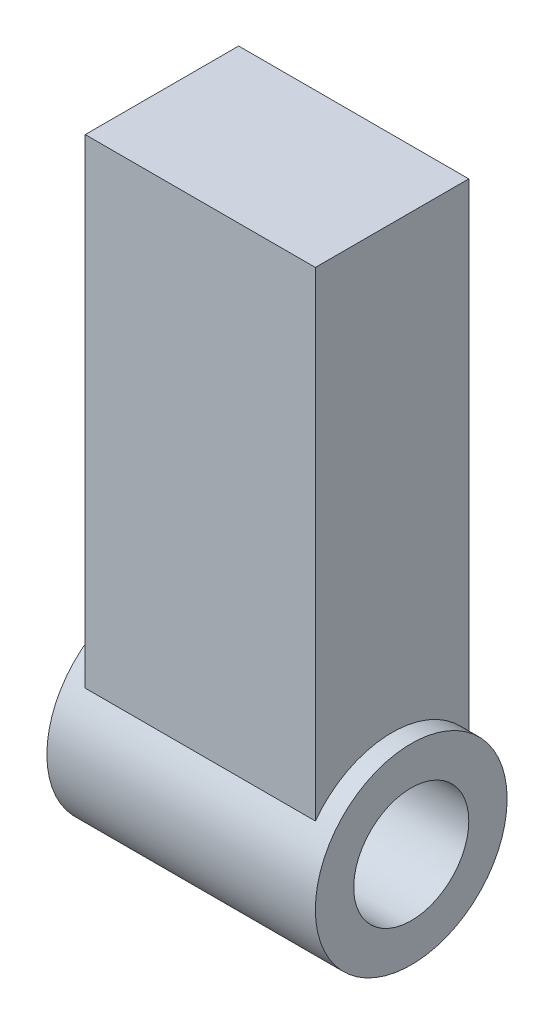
from build123d import *

# Parameters (mm, degrees)
SKIZZE1_W                    = 60
SKIZZE1_H                    = 40
LINEAR_AUSTRAGEN1_DEPTH      = 100
LINEAR_AUSTRAGEN2_DEPTH      = 65
LINEAR_AUSTRAGEN2_DEPTH_BACK = 5
SKIZZE2_R                    = 25
SKIZZE2_R_2                  = 15
LINEAR_AUSTRAGEN3_REACH      = 129.475
SKIZZE3_W                    = 60
SKIZZE3_H                    = 40


with BuildPart() as part:
    # Skizze1 → Linear austragen1 (new body)
    with BuildSketch(Plane(origin=(0, 0, 0), x_dir=(1, 0, 0), z_dir=(0, 1, 0))):
        with Locations((30, 20)):
            Rectangle(SKIZZE1_W, SKIZZE1_H)
    extrude(amount=LINEAR_AUSTRAGEN1_DEPTH)


with BuildPart() as body_2:
    # Skizze2 → Linear austragen2 (new, two sides: drawn at the far end of the back side and taken through both)
    with BuildSketch(Plane(origin=(0, 0, 0), x_dir=(0, 0, -1), z_dir=(1, 0, 0)).offset(-LINEAR_AUSTRAGEN2_DEPTH_BACK)):
        with Locations((20, -40)):
            Circle(SKIZZE2_R)
        with Locations((20, -40)):
            Circle(SKIZZE2_R_2, mode=Mode.SUBTRACT)
    extrude(amount=LINEAR_AUSTRAGEN2_DEPTH + LINEAR_AUSTRAGEN2_DEPTH_BACK)

    # Skizze3 → Linear austragen3 (add, up to next)
    with BuildSketch(Plane.XZ, mode=Mode.PRIVATE) as linear_austragen3_sk1:
        with Locations((30, -20)):
            Rectangle(SKIZZE3_W, SKIZZE3_H)
    linear_austragen3_tool1 = extrude(linear_austragen3_sk1.sketch, amount=LINEAR_AUSTRAGEN3_REACH, mode=Mode.PRIVATE) - body_2.part

    add(part.part)  # Linear austragen3 merges part
    add(linear_austragen3_tool1.solids().sort_by_distance((30, 0, -20))[0])


solid = body_2.part
